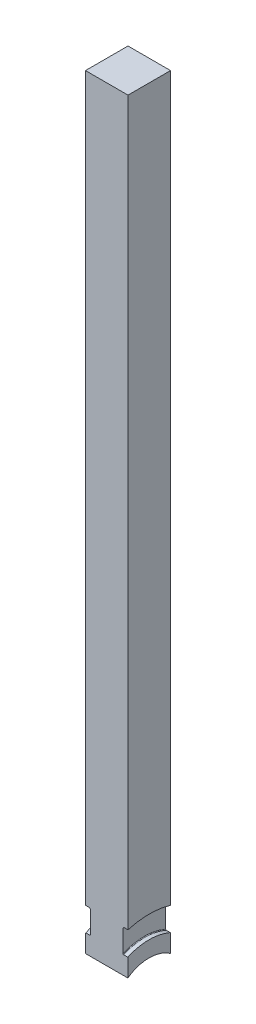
ISO-10303-21;
HEADER;
FILE_DESCRIPTION(('STEP AP214'),'2;1');
FILE_NAME('part.step','',(''),(''),'','','');
FILE_SCHEMA(('AUTOMOTIVE_DESIGN { 1 0 10303 214 1 1 1 1 }'));
ENDSEC;
DATA;
#1=APPLICATION_CONTEXT('core data for automotive mechanical design processes');
#2=APPLICATION_PROTOCOL_DEFINITION('international standard','automotive_design',2000,#1);
#3=PRODUCT_CONTEXT('',#1,'mechanical');
#4=PRODUCT('Part','Part','',(#3));
#5=PRODUCT_RELATED_PRODUCT_CATEGORY('part','',(#4));
#6=PRODUCT_DEFINITION_FORMATION('','',#4);
#7=PRODUCT_DEFINITION_CONTEXT('part definition',#1,'design');
#8=PRODUCT_DEFINITION('design','',#6,#7);
#9=PRODUCT_DEFINITION_SHAPE('','',#8);
#10=(LENGTH_UNIT() NAMED_UNIT(*) SI_UNIT(.MILLI.,.METRE.));
#11=(NAMED_UNIT(*) PLANE_ANGLE_UNIT() SI_UNIT($,.RADIAN.));
#12=(NAMED_UNIT(*) SI_UNIT($,.STERADIAN.) SOLID_ANGLE_UNIT());
#13=UNCERTAINTY_MEASURE_WITH_UNIT(LENGTH_MEASURE(1.E-05),#10,'distance_accuracy_value','');
#14=(GEOMETRIC_REPRESENTATION_CONTEXT(3) GLOBAL_UNCERTAINTY_ASSIGNED_CONTEXT((#13)) GLOBAL_UNIT_ASSIGNED_CONTEXT((#10,
#11,#12)) REPRESENTATION_CONTEXT('',''));
#15=CARTESIAN_POINT('',(0.,0.,0.));
#16=DIRECTION('',(0.,0.,1.));
#17=DIRECTION('',(1.,0.,0.));
#18=AXIS2_PLACEMENT_3D('',#15,#16,#17);
#19=CARTESIAN_POINT('',(12.827,479.425,12.827));
#20=DIRECTION('',(0.,0.,-1.));
#21=DIRECTION('',(0.,1.,0.));
#22=AXIS2_PLACEMENT_3D('',#19,#20,#21);
#23=PLANE('',#22);
#24=DIRECTION('',(-1.,0.,0.));
#25=VECTOR('',#24,1.);
#26=CARTESIAN_POINT('',(-8.84822894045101,29.043597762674,12.827));
#27=LINE('',#26,#25);
#28=CARTESIAN_POINT('',(-12.7,29.043597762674,12.827));
#29=VERTEX_POINT('',#28);
#30=CARTESIAN_POINT('',(-10.2362,29.043597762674,12.827));
#31=VERTEX_POINT('',#30);
#32=EDGE_CURVE('E196',#29,#31,#27,.F.);
#33=ORIENTED_EDGE('',*,*,#32,.F.);
#34=DIRECTION('',(0.,1.,0.));
#35=VECTOR('',#34,1.);
#36=CARTESIAN_POINT('',(-12.7,31.75,12.827));
#37=LINE('',#36,#35);
#38=CARTESIAN_POINT('',(-12.7,18.149895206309,12.827));
#39=VERTEX_POINT('',#38);
#40=EDGE_CURVE('E178',#39,#29,#37,.T.);
#41=ORIENTED_EDGE('',*,*,#40,.F.);
#42=DIRECTION('',(1.,0.,0.));
#43=VECTOR('',#42,1.);
#44=CARTESIAN_POINT('',(-12.827,18.1498952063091,12.827));
#45=LINE('',#44,#43);
#46=CARTESIAN_POINT('',(12.7,18.149895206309,12.827));
#47=VERTEX_POINT('',#46);
#48=EDGE_CURVE('E176',#39,#47,#45,.T.);
#49=ORIENTED_EDGE('',*,*,#48,.T.);
#50=DIRECTION('',(0.,-1.,0.));
#51=VECTOR('',#50,1.);
#52=CARTESIAN_POINT('',(12.7,31.75,12.827));
#53=LINE('',#52,#51);
#54=CARTESIAN_POINT('',(12.7,29.043597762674,12.827));
#55=VERTEX_POINT('',#54);
#56=EDGE_CURVE('E165',#55,#47,#53,.T.);
#57=ORIENTED_EDGE('',*,*,#56,.F.);
#58=DIRECTION('',(-1.,0.,0.));
#59=VECTOR('',#58,1.);
#60=CARTESIAN_POINT('',(-8.84822894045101,29.043597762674,12.827));
#61=LINE('',#60,#59);
#62=CARTESIAN_POINT('',(10.2362,29.043597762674,12.827));
#63=VERTEX_POINT('',#62);
#64=EDGE_CURVE('E152',#63,#55,#61,.F.);
#65=ORIENTED_EDGE('',*,*,#64,.F.);
#66=CARTESIAN_POINT('',(10.2362,29.043597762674,12.827));
#67=CARTESIAN_POINT('',(10.2160708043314,29.0435722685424,12.827));
#68=CARTESIAN_POINT('',(10.1959577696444,29.0453398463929,12.827));
#69=CARTESIAN_POINT('',(10.1563845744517,29.0522597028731,12.827));
#70=CARTESIAN_POINT('',(10.1369225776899,29.057401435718,12.827));
#71=CARTESIAN_POINT('',(10.0991468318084,29.0708679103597,12.827));
#72=CARTESIAN_POINT('',(10.0808326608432,29.0791914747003,12.827));
#73=CARTESIAN_POINT('',(10.0457902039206,29.0986936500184,12.827));
#74=CARTESIAN_POINT('',(10.0290627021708,29.1098736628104,12.827));
#75=CARTESIAN_POINT('',(9.99700861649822,29.1351379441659,12.827));
#76=CARTESIAN_POINT('',(9.98175149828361,29.1493101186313,12.827));
#77=CARTESIAN_POINT('',(9.95361671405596,29.1798419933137,12.827));
#78=CARTESIAN_POINT('',(9.9407396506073,29.1962022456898,12.827));
#79=CARTESIAN_POINT('',(9.91662869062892,29.2320467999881,12.827));
#80=CARTESIAN_POINT('',(9.90561137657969,29.2516766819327,12.827));
#81=CARTESIAN_POINT('',(9.8867485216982,29.2924113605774,12.827));
#82=CARTESIAN_POINT('',(9.87890468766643,29.3135169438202,12.827));
#83=CARTESIAN_POINT('',(9.86687995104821,29.3553145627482,12.827));
#84=CARTESIAN_POINT('',(9.86250087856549,29.375950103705,12.827));
#85=CARTESIAN_POINT('',(9.85666099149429,29.417597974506,12.827));
#86=CARTESIAN_POINT('',(9.85519567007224,29.4386096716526,12.827));
#87=CARTESIAN_POINT('',(9.8552,29.4596203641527,12.827));
#88=B_SPLINE_CURVE_WITH_KNOTS('',3,(#66,#67,#68,#69,#70,#71,#72,#73,#74,#75,#76,#77,#78,#79,#80,
#81,#82,#83,#84,#85,#86,#87),.UNSPECIFIED.,.F.,.F.,(4,2,2,2,2,2,2,2,2,2,4),(0.,
0.0602849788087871,0.120382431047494,0.180457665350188,0.240562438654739,0.302769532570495,
0.364992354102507,0.432238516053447,0.499520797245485,0.562601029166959,0.625583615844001),.UNSPECIFIED.);
#89=CARTESIAN_POINT('',(9.8552,29.4596203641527,12.827));
#90=VERTEX_POINT('',#89);
#91=EDGE_CURVE('E11',#63,#90,#88,.T.);
#92=ORIENTED_EDGE('',*,*,#91,.T.);
#93=DIRECTION('',(0.,-1.,0.));
#94=VECTOR('',#93,1.);
#95=CARTESIAN_POINT('',(9.8552,479.425,12.827));
#96=LINE('',#95,#94);
#97=CARTESIAN_POINT('',(9.8552,42.5855524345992,12.827));
#98=VERTEX_POINT('',#97);
#99=EDGE_CURVE('E211',#98,#90,#96,.T.);
#100=ORIENTED_EDGE('',*,*,#99,.F.);
#101=CARTESIAN_POINT('',(9.8552,42.5855524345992,12.827));
#102=CARTESIAN_POINT('',(9.85517024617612,42.6317662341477,12.827));
#103=CARTESIAN_POINT('',(9.85905310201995,42.6779817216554,12.827));
#104=CARTESIAN_POINT('',(9.87444611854,42.7691513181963,12.827));
#105=CARTESIAN_POINT('',(9.88596063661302,42.8141046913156,12.827));
#106=CARTESIAN_POINT('',(9.91643311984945,42.9014710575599,12.827));
#107=CARTESIAN_POINT('',(9.93539815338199,42.9438815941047,12.827));
#108=CARTESIAN_POINT('',(9.98032447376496,43.0247993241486,12.827));
#109=CARTESIAN_POINT('',(10.0062818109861,43.0633087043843,12.827));
#110=CARTESIAN_POINT('',(10.0639112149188,43.1343937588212,12.827));
#111=CARTESIAN_POINT('',(10.0954452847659,43.1670811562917,12.827));
#112=CARTESIAN_POINT('',(10.1637735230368,43.226428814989,12.827));
#113=CARTESIAN_POINT('',(10.200568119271,43.2530885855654,12.827));
#114=CARTESIAN_POINT('',(10.2767372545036,43.2984392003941,12.827));
#115=CARTESIAN_POINT('',(10.3159443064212,43.3174118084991,12.827));
#116=CARTESIAN_POINT('',(10.3970519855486,43.348201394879,12.827));
#117=CARTESIAN_POINT('',(10.438949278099,43.3600270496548,12.827));
#118=CARTESIAN_POINT('',(10.5038932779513,43.3722863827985,12.827));
#119=CARTESIAN_POINT('',(10.526453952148,43.3754629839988,12.827));
#120=CARTESIAN_POINT('',(10.571739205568,43.3796991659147,12.827));
#121=CARTESIAN_POINT('',(10.594463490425,43.3807618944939,12.827));
#122=CARTESIAN_POINT('',(10.6171999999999,43.3807610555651,12.827));
#123=B_SPLINE_CURVE_WITH_KNOTS('',3,(#101,#102,#103,#104,#105,#106,#107,#108,#109,#110,#111,
#112,#113,#114,#115,#116,#117,#118,#119,#120,#121,#122),.UNSPECIFIED.,.F.,.F.,(4,2,2,2,2,2,2,2,
2,2,4),(0.,0.138483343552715,0.277045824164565,0.415740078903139,0.554356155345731,
0.689928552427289,0.825511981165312,0.955539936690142,1.08540971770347,1.15367212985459,
1.22183281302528),.UNSPECIFIED.);
#124=CARTESIAN_POINT('',(10.6172,43.3807610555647,12.827));
#125=VERTEX_POINT('',#124);
#126=EDGE_CURVE('E295',#98,#125,#123,.T.);
#127=ORIENTED_EDGE('',*,*,#126,.T.);
#128=DIRECTION('',(-1.,0.,0.));
#129=VECTOR('',#128,1.);
#130=CARTESIAN_POINT('',(-8.84822894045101,43.3807610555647,12.827));
#131=LINE('',#130,#129);
#132=CARTESIAN_POINT('',(12.827,43.3807610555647,12.827));
#133=VERTEX_POINT('',#132);
#134=EDGE_CURVE('E206',#133,#125,#131,.T.);
#135=ORIENTED_EDGE('',*,*,#134,.F.);
#136=DIRECTION('',(0.,-1.,0.));
#137=VECTOR('',#136,1.);
#138=CARTESIAN_POINT('',(12.827,479.425,12.827));
#139=LINE('',#138,#137);
#140=CARTESIAN_POINT('',(12.827,479.425,12.827));
#141=VERTEX_POINT('',#140);
#142=EDGE_CURVE('E222',#141,#133,#139,.T.);
#143=ORIENTED_EDGE('',*,*,#142,.F.);
#144=DIRECTION('',(-1.,0.,0.));
#145=VECTOR('',#144,1.);
#146=CARTESIAN_POINT('',(12.827,479.425,12.827));
#147=LINE('',#146,#145);
#148=CARTESIAN_POINT('',(-12.827,479.425,12.827));
#149=VERTEX_POINT('',#148);
#150=EDGE_CURVE('E237',#141,#149,#147,.T.);
#151=ORIENTED_EDGE('',*,*,#150,.T.);
#152=DIRECTION('',(0.,-1.,0.));
#153=VECTOR('',#152,1.);
#154=CARTESIAN_POINT('',(-12.827,479.425,12.827));
#155=LINE('',#154,#153);
#156=CARTESIAN_POINT('',(-12.827,43.3807610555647,12.827));
#157=VERTEX_POINT('',#156);
#158=EDGE_CURVE('E231',#149,#157,#155,.T.);
#159=ORIENTED_EDGE('',*,*,#158,.T.);
#160=DIRECTION('',(-1.,0.,0.));
#161=VECTOR('',#160,1.);
#162=CARTESIAN_POINT('',(-8.84822894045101,43.3807610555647,12.827));
#163=LINE('',#162,#161);
#164=CARTESIAN_POINT('',(-10.6172,43.3807610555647,12.827));
#165=VERTEX_POINT('',#164);
#166=EDGE_CURVE('E202',#165,#157,#163,.T.);
#167=ORIENTED_EDGE('',*,*,#166,.F.);
#168=CARTESIAN_POINT('',(-10.6172,43.3807610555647,12.827));
#169=CARTESIAN_POINT('',(-10.5756065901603,43.3808045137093,12.827));
#170=CARTESIAN_POINT('',(-10.5340342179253,43.3772126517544,12.827));
#171=CARTESIAN_POINT('',(-10.4521637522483,43.363091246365,12.827));
#172=CARTESIAN_POINT('',(-10.411863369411,43.3525750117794,12.827));
#173=CARTESIAN_POINT('',(-10.3335975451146,43.3249343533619,12.827));
#174=CARTESIAN_POINT('',(-10.295632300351,43.3078093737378,12.827));
#175=CARTESIAN_POINT('',(-10.223045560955,43.2675367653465,12.827));
#176=CARTESIAN_POINT('',(-10.1884245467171,43.2443882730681,12.827));
#177=CARTESIAN_POINT('',(-10.1228284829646,43.1923475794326,12.827));
#178=CARTESIAN_POINT('',(-10.0919268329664,43.1633629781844,12.827));
#179=CARTESIAN_POINT('',(-10.0352031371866,43.1007883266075,12.827));
#180=CARTESIAN_POINT('',(-10.0093823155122,43.0671971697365,12.827));
#181=CARTESIAN_POINT('',(-9.96248271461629,42.9949745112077,12.827));
#182=CARTESIAN_POINT('',(-9.9416282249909,42.9561975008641,12.827));
#183=CARTESIAN_POINT('',(-9.90645002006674,42.8757858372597,12.827));
#184=CARTESIAN_POINT('',(-9.89212634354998,42.8341511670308,12.827));
#185=CARTESIAN_POINT('',(-9.87256356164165,42.7580053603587,12.827));
#186=CARTESIAN_POINT('',(-9.86605461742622,42.7238136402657,12.827));
#187=CARTESIAN_POINT('',(-9.85737265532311,42.6549344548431,12.827));
#188=CARTESIAN_POINT('',(-9.85519333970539,42.6202477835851,12.827));
#189=CARTESIAN_POINT('',(-9.85520000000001,42.5855524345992,12.827));
#190=B_SPLINE_CURVE_WITH_KNOTS('',3,(#168,#169,#170,#171,#172,#173,#174,#175,#176,#177,#178,
#179,#180,#181,#182,#183,#184,#185,#186,#187,#188,#189),.UNSPECIFIED.,.F.,.F.,(4,2,2,2,2,2,2,2,
2,2,4),(0.,0.124593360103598,0.248947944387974,0.373312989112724,0.497695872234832,
0.624229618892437,0.750793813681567,0.882295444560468,1.01379785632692,1.11794997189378,
1.22195048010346),.UNSPECIFIED.);
#191=CARTESIAN_POINT('',(-9.85520000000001,42.5855524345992,12.827));
#192=VERTEX_POINT('',#191);
#193=EDGE_CURVE('E264',#165,#192,#190,.T.);
#194=ORIENTED_EDGE('',*,*,#193,.T.);
#195=DIRECTION('',(0.,1.,0.));
#196=VECTOR('',#195,1.);
#197=CARTESIAN_POINT('',(-9.85520000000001,479.425,12.827));
#198=LINE('',#197,#196);
#199=CARTESIAN_POINT('',(-9.85520000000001,29.4596203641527,12.827));
#200=VERTEX_POINT('',#199);
#201=EDGE_CURVE('E160',#200,#192,#198,.T.);
#202=ORIENTED_EDGE('',*,*,#201,.F.);
#203=CARTESIAN_POINT('',(-9.85520000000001,29.4596203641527,12.827));
#204=CARTESIAN_POINT('',(-9.85518989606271,29.434572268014,12.827));
#205=CARTESIAN_POINT('',(-9.85727632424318,29.4095174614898,12.827));
#206=CARTESIAN_POINT('',(-9.86557747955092,29.3600490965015,12.827));
#207=CARTESIAN_POINT('',(-9.87180075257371,29.3356369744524,12.827));
#208=CARTESIAN_POINT('',(-9.8883214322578,29.2881862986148,12.827));
#209=CARTESIAN_POINT('',(-9.89862433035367,29.2651496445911,12.827));
#210=CARTESIAN_POINT('',(-9.92312499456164,29.2212642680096,12.827));
#211=CARTESIAN_POINT('',(-9.93731902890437,29.2004134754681,12.827));
#212=CARTESIAN_POINT('',(-9.96856972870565,29.1625759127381,12.827));
#213=CARTESIAN_POINT('',(-9.98546338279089,29.145454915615,12.827));
#214=CARTESIAN_POINT('',(-10.0221325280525,29.1146162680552,12.827));
#215=CARTESIAN_POINT('',(-10.0419075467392,29.1008980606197,12.827));
#216=CARTESIAN_POINT('',(-10.0819198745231,29.0785475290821,12.827));
#217=CARTESIAN_POINT('',(-10.1019691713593,29.0695778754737,12.827));
#218=CARTESIAN_POINT('',(-10.1433538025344,29.0554628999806,12.827));
#219=CARTESIAN_POINT('',(-10.1646864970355,29.0503099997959,12.827));
#220=CARTESIAN_POINT('',(-10.1945530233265,29.0459922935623,12.827));
#221=CARTESIAN_POINT('',(-10.2028633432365,29.0450944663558,12.827));
#222=CARTESIAN_POINT('',(-10.2195142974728,29.0438978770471,12.827));
#223=CARTESIAN_POINT('',(-10.2278548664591,29.0435982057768,12.827));
#224=CARTESIAN_POINT('',(-10.2362,29.043597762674,12.827));
#225=B_SPLINE_CURVE_WITH_KNOTS('',3,(#203,#204,#205,#206,#207,#208,#209,#210,#211,#212,#213,
#214,#215,#216,#217,#218,#219,#220,#221,#222,#223,#224),.UNSPECIFIED.,.F.,.F.,(4,2,2,2,2,2,2,2,
2,2,4),(0.,0.0750698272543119,0.150295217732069,0.225622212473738,0.300877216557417,
0.372647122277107,0.444405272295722,0.509955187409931,0.57537459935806,0.600433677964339,
0.625454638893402),.UNSPECIFIED.);
#226=EDGE_CURVE('E309',#200,#31,#225,.T.);
#227=ORIENTED_EDGE('',*,*,#226,.T.);
#228=EDGE_LOOP('',(#33,#41,#49,#57,#65,#92,#100,#127,#135,#143,#151,#159,#167,#194,#202,#227));
#229=FACE_BOUND('',#228,.T.);
#230=ADVANCED_FACE('F37',(#229),#23,.F.);
#231=CARTESIAN_POINT('',(12.827,479.425,-12.827));
#232=DIRECTION('',(0.,0.,1.));
#233=DIRECTION('',(0.,-1.,0.));
#234=AXIS2_PLACEMENT_3D('',#231,#232,#233);
#235=PLANE('',#234);
#236=DIRECTION('',(1.,0.,0.));
#237=VECTOR('',#236,1.);
#238=CARTESIAN_POINT('',(-12.827,18.149895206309,-12.827));
#239=LINE('',#238,#237);
#240=CARTESIAN_POINT('',(12.7,18.149895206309,-12.827));
#241=VERTEX_POINT('',#240);
#242=CARTESIAN_POINT('',(-12.7,18.149895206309,-12.827));
#243=VERTEX_POINT('',#242);
#244=EDGE_CURVE('E214',#241,#243,#239,.F.);
#245=ORIENTED_EDGE('',*,*,#244,.T.);
#246=DIRECTION('',(0.,1.,0.));
#247=VECTOR('',#246,1.);
#248=CARTESIAN_POINT('',(-12.7,31.75,-12.827));
#249=LINE('',#248,#247);
#250=CARTESIAN_POINT('',(-12.7,29.043597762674,-12.827));
#251=VERTEX_POINT('',#250);
#252=EDGE_CURVE('E181',#243,#251,#249,.T.);
#253=ORIENTED_EDGE('',*,*,#252,.T.);
#254=DIRECTION('',(-1.,0.,0.));
#255=VECTOR('',#254,1.);
#256=CARTESIAN_POINT('',(-8.84822894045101,29.043597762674,-12.827));
#257=LINE('',#256,#255);
#258=CARTESIAN_POINT('',(-10.2362,29.043597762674,-12.827));
#259=VERTEX_POINT('',#258);
#260=EDGE_CURVE('E193',#259,#251,#257,.T.);
#261=ORIENTED_EDGE('',*,*,#260,.F.);
#262=CARTESIAN_POINT('',(-10.2362,29.043597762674,-12.827));
#263=CARTESIAN_POINT('',(-10.2160708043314,29.0435722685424,-12.827));
#264=CARTESIAN_POINT('',(-10.1959577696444,29.0453398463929,-12.827));
#265=CARTESIAN_POINT('',(-10.1563845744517,29.0522597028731,-12.827));
#266=CARTESIAN_POINT('',(-10.1369225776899,29.0574014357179,-12.827));
#267=CARTESIAN_POINT('',(-10.0991468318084,29.0708679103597,-12.827));
#268=CARTESIAN_POINT('',(-10.0808326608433,29.0791914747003,-12.827));
#269=CARTESIAN_POINT('',(-10.0457902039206,29.0986936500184,-12.827));
#270=CARTESIAN_POINT('',(-10.0290627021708,29.1098736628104,-12.827));
#271=CARTESIAN_POINT('',(-9.99700861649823,29.1351379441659,-12.827));
#272=CARTESIAN_POINT('',(-9.98175149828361,29.1493101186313,-12.827));
#273=CARTESIAN_POINT('',(-9.95361671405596,29.1798419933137,-12.827));
#274=CARTESIAN_POINT('',(-9.94073965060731,29.1962022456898,-12.827));
#275=CARTESIAN_POINT('',(-9.91662869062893,29.2320467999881,-12.827));
#276=CARTESIAN_POINT('',(-9.9056113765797,29.2516766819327,-12.827));
#277=CARTESIAN_POINT('',(-9.88674852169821,29.2924113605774,-12.827));
#278=CARTESIAN_POINT('',(-9.87890468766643,29.3135169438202,-12.827));
#279=CARTESIAN_POINT('',(-9.86687995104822,29.3553145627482,-12.827));
#280=CARTESIAN_POINT('',(-9.86250087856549,29.375950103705,-12.827));
#281=CARTESIAN_POINT('',(-9.85666099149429,29.4175979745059,-12.827));
#282=CARTESIAN_POINT('',(-9.85519567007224,29.4386096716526,-12.827));
#283=CARTESIAN_POINT('',(-9.85520000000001,29.4596203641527,-12.827));
#284=B_SPLINE_CURVE_WITH_KNOTS('',3,(#262,#263,#264,#265,#266,#267,#268,#269,#270,#271,#272,
#273,#274,#275,#276,#277,#278,#279,#280,#281,#282,#283),.UNSPECIFIED.,.F.,.F.,(4,2,2,2,2,2,2,2,
2,2,4),(0.,0.0602849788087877,0.120382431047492,0.180457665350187,0.240562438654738,
0.302769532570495,0.364992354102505,0.432238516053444,0.49952079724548,0.562601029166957,
0.625583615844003),.UNSPECIFIED.);
#285=CARTESIAN_POINT('',(-9.85520000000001,29.4596203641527,-12.827));
#286=VERTEX_POINT('',#285);
#287=EDGE_CURVE('E315',#259,#286,#284,.T.);
#288=ORIENTED_EDGE('',*,*,#287,.T.);
#289=DIRECTION('',(0.,-1.,0.));
#290=VECTOR('',#289,1.);
#291=CARTESIAN_POINT('',(-9.85520000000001,479.425,-12.827));
#292=LINE('',#291,#290);
#293=CARTESIAN_POINT('',(-9.85520000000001,42.5855524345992,-12.827));
#294=VERTEX_POINT('',#293);
#295=EDGE_CURVE('E240',#294,#286,#292,.T.);
#296=ORIENTED_EDGE('',*,*,#295,.F.);
#297=CARTESIAN_POINT('',(-9.85520000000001,42.5855524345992,-12.827));
#298=CARTESIAN_POINT('',(-9.85517024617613,42.6317662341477,-12.827));
#299=CARTESIAN_POINT('',(-9.85905310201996,42.6779817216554,-12.827));
#300=CARTESIAN_POINT('',(-9.87444611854,42.7691513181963,-12.827));
#301=CARTESIAN_POINT('',(-9.88596063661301,42.8141046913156,-12.827));
#302=CARTESIAN_POINT('',(-9.91643311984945,42.9014710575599,-12.827));
#303=CARTESIAN_POINT('',(-9.935398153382,42.9438815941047,-12.827));
#304=CARTESIAN_POINT('',(-9.98032447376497,43.0247993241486,-12.827));
#305=CARTESIAN_POINT('',(-10.0062818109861,43.0633087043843,-12.827));
#306=CARTESIAN_POINT('',(-10.0639112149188,43.1343937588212,-12.827));
#307=CARTESIAN_POINT('',(-10.0954452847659,43.1670811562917,-12.827));
#308=CARTESIAN_POINT('',(-10.1637735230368,43.226428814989,-12.827));
#309=CARTESIAN_POINT('',(-10.200568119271,43.2530885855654,-12.827));
#310=CARTESIAN_POINT('',(-10.2767372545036,43.2984392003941,-12.827));
#311=CARTESIAN_POINT('',(-10.3159443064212,43.3174118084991,-12.827));
#312=CARTESIAN_POINT('',(-10.3970519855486,43.348201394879,-12.827));
#313=CARTESIAN_POINT('',(-10.438949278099,43.3600270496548,-12.827));
#314=CARTESIAN_POINT('',(-10.5038932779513,43.3722863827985,-12.827));
#315=CARTESIAN_POINT('',(-10.526453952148,43.3754629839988,-12.827));
#316=CARTESIAN_POINT('',(-10.571739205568,43.3796991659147,-12.827));
#317=CARTESIAN_POINT('',(-10.594463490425,43.3807618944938,-12.827));
#318=CARTESIAN_POINT('',(-10.6171999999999,43.3807610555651,-12.827));
#319=B_SPLINE_CURVE_WITH_KNOTS('',3,(#297,#298,#299,#300,#301,#302,#303,#304,#305,#306,#307,
#308,#309,#310,#311,#312,#313,#314,#315,#316,#317,#318),.UNSPECIFIED.,.F.,.F.,(4,2,2,2,2,2,2,2,
2,2,4),(0.,0.138483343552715,0.277045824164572,0.415740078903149,0.554356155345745,
0.689928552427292,0.825511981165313,0.955539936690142,1.08540971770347,1.1536721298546,
1.22183281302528),.UNSPECIFIED.);
#320=CARTESIAN_POINT('',(-10.6172,43.3807610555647,-12.827));
#321=VERTEX_POINT('',#320);
#322=EDGE_CURVE('E256',#294,#321,#319,.T.);
#323=ORIENTED_EDGE('',*,*,#322,.T.);
#324=DIRECTION('',(-1.,0.,0.));
#325=VECTOR('',#324,1.);
#326=CARTESIAN_POINT('',(-8.84822894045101,43.3807610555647,-12.827));
#327=LINE('',#326,#325);
#328=CARTESIAN_POINT('',(-12.827,43.3807610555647,-12.827));
#329=VERTEX_POINT('',#328);
#330=EDGE_CURVE('E199',#329,#321,#327,.F.);
#331=ORIENTED_EDGE('',*,*,#330,.F.);
#332=DIRECTION('',(0.,1.,0.));
#333=VECTOR('',#332,1.);
#334=CARTESIAN_POINT('',(-12.827,479.425,-12.827));
#335=LINE('',#334,#333);
#336=CARTESIAN_POINT('',(-12.827,479.425,-12.827));
#337=VERTEX_POINT('',#336);
#338=EDGE_CURVE('E223',#329,#337,#335,.T.);
#339=ORIENTED_EDGE('',*,*,#338,.T.);
#340=DIRECTION('',(-1.,0.,0.));
#341=VECTOR('',#340,1.);
#342=CARTESIAN_POINT('',(12.827,479.425,-12.827));
#343=LINE('',#342,#341);
#344=CARTESIAN_POINT('',(12.827,479.425,-12.827));
#345=VERTEX_POINT('',#344);
#346=EDGE_CURVE('E228',#345,#337,#343,.T.);
#347=ORIENTED_EDGE('',*,*,#346,.F.);
#348=DIRECTION('',(0.,1.,0.));
#349=VECTOR('',#348,1.);
#350=CARTESIAN_POINT('',(12.827,479.425,-12.827));
#351=LINE('',#350,#349);
#352=CARTESIAN_POINT('',(12.827,43.3807610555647,-12.827));
#353=VERTEX_POINT('',#352);
#354=EDGE_CURVE('E226',#353,#345,#351,.T.);
#355=ORIENTED_EDGE('',*,*,#354,.F.);
#356=DIRECTION('',(-1.,0.,0.));
#357=VECTOR('',#356,1.);
#358=CARTESIAN_POINT('',(-8.84822894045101,43.3807610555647,-12.827));
#359=LINE('',#358,#357);
#360=CARTESIAN_POINT('',(10.6172,43.3807610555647,-12.827));
#361=VERTEX_POINT('',#360);
#362=EDGE_CURVE('E204',#361,#353,#359,.F.);
#363=ORIENTED_EDGE('',*,*,#362,.F.);
#364=CARTESIAN_POINT('',(10.6172,43.3807610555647,-12.827));
#365=CARTESIAN_POINT('',(10.5756065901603,43.3808045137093,-12.827));
#366=CARTESIAN_POINT('',(10.5340342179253,43.3772126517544,-12.827));
#367=CARTESIAN_POINT('',(10.4521637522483,43.363091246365,-12.827));
#368=CARTESIAN_POINT('',(10.411863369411,43.3525750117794,-12.827));
#369=CARTESIAN_POINT('',(10.3335975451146,43.3249343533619,-12.827));
#370=CARTESIAN_POINT('',(10.295632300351,43.3078093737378,-12.827));
#371=CARTESIAN_POINT('',(10.223045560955,43.2675367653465,-12.827));
#372=CARTESIAN_POINT('',(10.1884245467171,43.2443882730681,-12.827));
#373=CARTESIAN_POINT('',(10.1228284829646,43.1923475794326,-12.827));
#374=CARTESIAN_POINT('',(10.0919268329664,43.1633629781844,-12.827));
#375=CARTESIAN_POINT('',(10.0352031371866,43.1007883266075,-12.827));
#376=CARTESIAN_POINT('',(10.0093823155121,43.0671971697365,-12.827));
#377=CARTESIAN_POINT('',(9.96248271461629,42.9949745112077,-12.827));
#378=CARTESIAN_POINT('',(9.9416282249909,42.9561975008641,-12.827));
#379=CARTESIAN_POINT('',(9.90645002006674,42.8757858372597,-12.827));
#380=CARTESIAN_POINT('',(9.89212634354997,42.8341511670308,-12.827));
#381=CARTESIAN_POINT('',(9.87256356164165,42.7580053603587,-12.827));
#382=CARTESIAN_POINT('',(9.86605461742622,42.7238136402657,-12.827));
#383=CARTESIAN_POINT('',(9.85737265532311,42.6549344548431,-12.827));
#384=CARTESIAN_POINT('',(9.85519333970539,42.6202477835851,-12.827));
#385=CARTESIAN_POINT('',(9.8552,42.5855524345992,-12.827));
#386=B_SPLINE_CURVE_WITH_KNOTS('',3,(#364,#365,#366,#367,#368,#369,#370,#371,#372,#373,#374,
#375,#376,#377,#378,#379,#380,#381,#382,#383,#384,#385),.UNSPECIFIED.,.F.,.F.,(4,2,2,2,2,2,2,2,
2,2,4),(0.,0.1245933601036,0.248947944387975,0.373312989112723,0.497695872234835,
0.624229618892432,0.750793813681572,0.88229544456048,1.01379785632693,1.11794997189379,
1.22195048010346),.UNSPECIFIED.);
#387=CARTESIAN_POINT('',(9.8552,42.5855524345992,-12.827));
#388=VERTEX_POINT('',#387);
#389=EDGE_CURVE('E289',#361,#388,#386,.T.);
#390=ORIENTED_EDGE('',*,*,#389,.T.);
#391=DIRECTION('',(0.,1.,0.));
#392=VECTOR('',#391,1.);
#393=CARTESIAN_POINT('',(9.8552,479.425,-12.827));
#394=LINE('',#393,#392);
#395=CARTESIAN_POINT('',(9.8552,29.4596203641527,-12.827));
#396=VERTEX_POINT('',#395);
#397=EDGE_CURVE('E170',#396,#388,#394,.T.);
#398=ORIENTED_EDGE('',*,*,#397,.F.);
#399=CARTESIAN_POINT('',(9.8552,29.4596203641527,-12.827));
#400=CARTESIAN_POINT('',(9.85518989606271,29.434572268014,-12.827));
#401=CARTESIAN_POINT('',(9.85727632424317,29.4095174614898,-12.827));
#402=CARTESIAN_POINT('',(9.86557747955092,29.3600490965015,-12.827));
#403=CARTESIAN_POINT('',(9.87180075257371,29.3356369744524,-12.827));
#404=CARTESIAN_POINT('',(9.8883214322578,29.2881862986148,-12.827));
#405=CARTESIAN_POINT('',(9.89862433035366,29.2651496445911,-12.827));
#406=CARTESIAN_POINT('',(9.92312499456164,29.2212642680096,-12.827));
#407=CARTESIAN_POINT('',(9.93731902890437,29.200413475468,-12.827));
#408=CARTESIAN_POINT('',(9.96856972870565,29.1625759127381,-12.827));
#409=CARTESIAN_POINT('',(9.98546338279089,29.145454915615,-12.827));
#410=CARTESIAN_POINT('',(10.0221325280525,29.1146162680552,-12.827));
#411=CARTESIAN_POINT('',(10.0419075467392,29.1008980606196,-12.827));
#412=CARTESIAN_POINT('',(10.081919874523,29.0785475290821,-12.827));
#413=CARTESIAN_POINT('',(10.1019691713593,29.0695778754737,-12.827));
#414=CARTESIAN_POINT('',(10.1433538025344,29.0554628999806,-12.827));
#415=CARTESIAN_POINT('',(10.1646864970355,29.0503099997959,-12.827));
#416=CARTESIAN_POINT('',(10.1945530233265,29.0459922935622,-12.827));
#417=CARTESIAN_POINT('',(10.2028633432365,29.0450944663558,-12.827));
#418=CARTESIAN_POINT('',(10.2195142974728,29.043897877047,-12.827));
#419=CARTESIAN_POINT('',(10.2278548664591,29.0435982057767,-12.827));
#420=CARTESIAN_POINT('',(10.2362,29.0435977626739,-12.827));
#421=B_SPLINE_CURVE_WITH_KNOTS('',3,(#399,#400,#401,#402,#403,#404,#405,#406,#407,#408,#409,
#410,#411,#412,#413,#414,#415,#416,#417,#418,#419,#420),.UNSPECIFIED.,.F.,.F.,(4,2,2,2,2,2,2,2,
2,2,4),(0.,0.0750698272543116,0.150295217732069,0.225622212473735,0.300877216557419,
0.372647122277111,0.444405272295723,0.509955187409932,0.575374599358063,0.600433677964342,
0.625454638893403),.UNSPECIFIED.);
#422=CARTESIAN_POINT('',(10.2362,29.043597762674,-12.827));
#423=VERTEX_POINT('',#422);
#424=EDGE_CURVE('E51',#396,#423,#421,.T.);
#425=ORIENTED_EDGE('',*,*,#424,.T.);
#426=DIRECTION('',(-1.,0.,0.));
#427=VECTOR('',#426,1.);
#428=CARTESIAN_POINT('',(-8.84822894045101,29.043597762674,-12.827));
#429=LINE('',#428,#427);
#430=CARTESIAN_POINT('',(12.7,29.043597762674,-12.827));
#431=VERTEX_POINT('',#430);
#432=EDGE_CURVE('E161',#431,#423,#429,.T.);
#433=ORIENTED_EDGE('',*,*,#432,.F.);
#434=DIRECTION('',(0.,-1.,0.));
#435=VECTOR('',#434,1.);
#436=CARTESIAN_POINT('',(12.7,31.75,-12.827));
#437=LINE('',#436,#435);
#438=EDGE_CURVE('E168',#431,#241,#437,.T.);
#439=ORIENTED_EDGE('',*,*,#438,.T.);
#440=EDGE_LOOP('',(#245,#253,#261,#288,#296,#323,#331,#339,#347,#355,#363,#390,#398,#425,#433,#439));
#441=FACE_BOUND('',#440,.T.);
#442=ADVANCED_FACE('F270',(#441),#235,.F.);
#443=CARTESIAN_POINT('',(-12.827,0.,0.));
#444=DIRECTION('',(-1.,0.,0.));
#445=DIRECTION('',(0.,0.,1.));
#446=AXIS2_PLACEMENT_3D('',#443,#444,#445);
#447=PLANE('',#446);
#448=ORIENTED_EDGE('',*,*,#338,.F.);
#449=CARTESIAN_POINT('',(-12.827,0.,0.));
#450=DIRECTION('',(-1.,0.,0.));
#451=DIRECTION('',(0.,0.,1.));
#452=AXIS2_PLACEMENT_3D('',#449,#450,#451);
#453=CIRCLE('',#452,45.2374);
#454=EDGE_CURVE('E189',#157,#329,#453,.T.);
#455=ORIENTED_EDGE('',*,*,#454,.F.);
#456=ORIENTED_EDGE('',*,*,#158,.F.);
#457=DIRECTION('',(0.,0.,1.));
#458=VECTOR('',#457,1.);
#459=CARTESIAN_POINT('',(-12.827,479.425,12.827));
#460=LINE('',#459,#458);
#461=EDGE_CURVE('E218',#337,#149,#460,.T.);
#462=ORIENTED_EDGE('',*,*,#461,.F.);
#463=EDGE_LOOP('',(#448,#455,#456,#462));
#464=FACE_BOUND('',#463,.T.);
#465=ADVANCED_FACE('F378',(#464),#447,.T.);
#466=CARTESIAN_POINT('',(12.827,479.425,12.827));
#467=DIRECTION('',(0.,-1.,0.));
#468=DIRECTION('',(0.,0.,-1.));
#469=AXIS2_PLACEMENT_3D('',#466,#467,#468);
#470=PLANE('',#469);
#471=ORIENTED_EDGE('',*,*,#461,.T.);
#472=ORIENTED_EDGE('',*,*,#150,.F.);
#473=DIRECTION('',(0.,0.,1.));
#474=VECTOR('',#473,1.);
#475=CARTESIAN_POINT('',(12.827,479.425,12.827));
#476=LINE('',#475,#474);
#477=EDGE_CURVE('E219',#345,#141,#476,.T.);
#478=ORIENTED_EDGE('',*,*,#477,.F.);
#479=ORIENTED_EDGE('',*,*,#346,.T.);
#480=EDGE_LOOP('',(#471,#472,#478,#479));
#481=FACE_BOUND('',#480,.T.);
#482=ADVANCED_FACE('F281',(#481),#470,.F.);
#483=CARTESIAN_POINT('',(12.827,0.,0.));
#484=DIRECTION('',(-1.,0.,0.));
#485=DIRECTION('',(0.,0.,1.));
#486=AXIS2_PLACEMENT_3D('',#483,#484,#485);
#487=PLANE('',#486);
#488=CARTESIAN_POINT('',(12.827,0.,0.));
#489=DIRECTION('',(-1.,0.,0.));
#490=DIRECTION('',(0.,0.,1.));
#491=AXIS2_PLACEMENT_3D('',#488,#489,#490);
#492=CIRCLE('',#491,45.2374);
#493=EDGE_CURVE('E190',#133,#353,#492,.T.);
#494=ORIENTED_EDGE('',*,*,#493,.T.);
#495=ORIENTED_EDGE('',*,*,#354,.T.);
#496=ORIENTED_EDGE('',*,*,#477,.T.);
#497=ORIENTED_EDGE('',*,*,#142,.T.);
#498=EDGE_LOOP('',(#494,#495,#496,#497));
#499=FACE_BOUND('',#498,.T.);
#500=ADVANCED_FACE('F366',(#499),#487,.F.);
#501=CARTESIAN_POINT('',(-12.827,0.,0.));
#502=DIRECTION('',(1.,0.,0.));
#503=DIRECTION('',(0.,0.,-1.));
#504=AXIS2_PLACEMENT_3D('',#501,#502,#503);
#505=CYLINDRICAL_SURFACE('',#504,22.225);
#506=ORIENTED_EDGE('',*,*,#48,.F.);
#507=CARTESIAN_POINT('',(-12.7,0.,0.));
#508=DIRECTION('',(1.,0.,0.));
#509=DIRECTION('',(0.,1.,0.));
#510=AXIS2_PLACEMENT_3D('',#507,#508,#509);
#511=CIRCLE('',#510,22.225);
#512=EDGE_CURVE('E186',#39,#243,#511,.F.);
#513=ORIENTED_EDGE('',*,*,#512,.T.);
#514=ORIENTED_EDGE('',*,*,#244,.F.);
#515=CARTESIAN_POINT('',(12.7,0.,0.));
#516=DIRECTION('',(-1.,0.,0.));
#517=DIRECTION('',(0.,-1.,0.));
#518=AXIS2_PLACEMENT_3D('',#515,#516,#517);
#519=CIRCLE('',#518,22.225);
#520=EDGE_CURVE('E184',#241,#47,#519,.F.);
#521=ORIENTED_EDGE('',*,*,#520,.T.);
#522=EDGE_LOOP('',(#506,#513,#514,#521));
#523=FACE_BOUND('',#522,.T.);
#524=ADVANCED_FACE('F385',(#523),#505,.F.);
#525=CARTESIAN_POINT('',(-9.85520000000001,31.75,0.));
#526=DIRECTION('',(-1.,0.,0.));
#527=DIRECTION('',(0.,0.,1.));
#528=AXIS2_PLACEMENT_3D('',#525,#526,#527);
#529=PLANE('',#528);
#530=ORIENTED_EDGE('',*,*,#295,.T.);
#531=CARTESIAN_POINT('',(-9.85520000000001,0.,0.));
#532=DIRECTION('',(-1.,0.,0.));
#533=DIRECTION('',(0.,0.,1.));
#534=AXIS2_PLACEMENT_3D('',#531,#532,#533);
#535=CIRCLE('',#534,32.131);
#536=EDGE_CURVE('E328',#286,#200,#535,.F.);
#537=ORIENTED_EDGE('',*,*,#536,.T.);
#538=ORIENTED_EDGE('',*,*,#201,.T.);
#539=CARTESIAN_POINT('',(-9.85520000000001,0.,0.));
#540=DIRECTION('',(-1.,0.,0.));
#541=DIRECTION('',(0.,0.,1.));
#542=AXIS2_PLACEMENT_3D('',#539,#540,#541);
#543=CIRCLE('',#542,44.4754);
#544=EDGE_CURVE('E246',#192,#294,#543,.T.);
#545=ORIENTED_EDGE('',*,*,#544,.T.);
#546=EDGE_LOOP('',(#530,#537,#538,#545));
#547=FACE_BOUND('',#546,.T.);
#548=ADVANCED_FACE('F383',(#547),#529,.T.);
#549=CARTESIAN_POINT('',(-8.84822894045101,0.,0.));
#550=DIRECTION('',(-1.,0.,0.));
#551=DIRECTION('',(0.,0.,1.));
#552=AXIS2_PLACEMENT_3D('',#549,#550,#551);
#553=CYLINDRICAL_SURFACE('',#552,45.2374);
#554=ORIENTED_EDGE('',*,*,#330,.T.);
#555=CARTESIAN_POINT('',(-10.6172,0.,0.));
#556=DIRECTION('',(-1.,0.,0.));
#557=DIRECTION('',(0.,0.,1.));
#558=AXIS2_PLACEMENT_3D('',#555,#556,#557);
#559=CIRCLE('',#558,45.2374);
#560=EDGE_CURVE('E249',#321,#165,#559,.F.);
#561=ORIENTED_EDGE('',*,*,#560,.T.);
#562=ORIENTED_EDGE('',*,*,#166,.T.);
#563=ORIENTED_EDGE('',*,*,#454,.T.);
#564=EDGE_LOOP('',(#554,#561,#562,#563));
#565=FACE_BOUND('',#564,.T.);
#566=ADVANCED_FACE('F380',(#565),#553,.F.);
#567=CARTESIAN_POINT('',(-8.84822894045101,0.,0.));
#568=DIRECTION('',(-1.,0.,0.));
#569=DIRECTION('',(0.,0.,1.));
#570=AXIS2_PLACEMENT_3D('',#567,#568,#569);
#571=CYLINDRICAL_SURFACE('',#570,31.75);
#572=ORIENTED_EDGE('',*,*,#32,.T.);
#573=CARTESIAN_POINT('',(-10.2362,0.,0.));
#574=DIRECTION('',(-1.,0.,0.));
#575=DIRECTION('',(0.,0.,1.));
#576=AXIS2_PLACEMENT_3D('',#573,#574,#575);
#577=CIRCLE('',#576,31.75);
#578=EDGE_CURVE('E301',#31,#259,#577,.T.);
#579=ORIENTED_EDGE('',*,*,#578,.T.);
#580=ORIENTED_EDGE('',*,*,#260,.T.);
#581=CARTESIAN_POINT('',(-12.7,0.,0.));
#582=DIRECTION('',(1.,0.,0.));
#583=DIRECTION('',(0.,1.,0.));
#584=AXIS2_PLACEMENT_3D('',#581,#582,#583);
#585=CIRCLE('',#584,31.75);
#586=EDGE_CURVE('E169',#29,#251,#585,.F.);
#587=ORIENTED_EDGE('',*,*,#586,.F.);
#588=EDGE_LOOP('',(#572,#579,#580,#587));
#589=FACE_BOUND('',#588,.T.);
#590=ADVANCED_FACE('F336',(#589),#571,.T.);
#591=CARTESIAN_POINT('',(9.8552,31.75,0.));
#592=DIRECTION('',(1.,0.,0.));
#593=DIRECTION('',(0.,0.,-1.));
#594=AXIS2_PLACEMENT_3D('',#591,#592,#593);
#595=PLANE('',#594);
#596=ORIENTED_EDGE('',*,*,#99,.T.);
#597=CARTESIAN_POINT('',(9.8552,0.,0.));
#598=DIRECTION('',(1.,0.,0.));
#599=DIRECTION('',(0.,0.,-1.));
#600=AXIS2_PLACEMENT_3D('',#597,#598,#599);
#601=CIRCLE('',#600,32.131);
#602=EDGE_CURVE('E326',#90,#396,#601,.F.);
#603=ORIENTED_EDGE('',*,*,#602,.T.);
#604=ORIENTED_EDGE('',*,*,#397,.T.);
#605=CARTESIAN_POINT('',(9.8552,0.,0.));
#606=DIRECTION('',(1.,0.,0.));
#607=DIRECTION('',(0.,0.,-1.));
#608=AXIS2_PLACEMENT_3D('',#605,#606,#607);
#609=CIRCLE('',#608,44.4754);
#610=EDGE_CURVE('E254',#388,#98,#609,.T.);
#611=ORIENTED_EDGE('',*,*,#610,.T.);
#612=EDGE_LOOP('',(#596,#603,#604,#611));
#613=FACE_BOUND('',#612,.T.);
#614=ADVANCED_FACE('F356',(#613),#595,.T.);
#615=CARTESIAN_POINT('',(-8.84822894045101,0.,0.));
#616=DIRECTION('',(-1.,0.,0.));
#617=DIRECTION('',(0.,0.,1.));
#618=AXIS2_PLACEMENT_3D('',#615,#616,#617);
#619=CYLINDRICAL_SURFACE('',#618,31.75);
#620=ORIENTED_EDGE('',*,*,#432,.T.);
#621=CARTESIAN_POINT('',(10.2362,0.,0.));
#622=DIRECTION('',(1.,0.,0.));
#623=DIRECTION('',(0.,0.,-1.));
#624=AXIS2_PLACEMENT_3D('',#621,#622,#623);
#625=CIRCLE('',#624,31.75);
#626=EDGE_CURVE('E58',#423,#63,#625,.T.);
#627=ORIENTED_EDGE('',*,*,#626,.T.);
#628=ORIENTED_EDGE('',*,*,#64,.T.);
#629=CARTESIAN_POINT('',(12.7,0.,0.));
#630=DIRECTION('',(-1.,0.,0.));
#631=DIRECTION('',(0.,-1.,0.));
#632=AXIS2_PLACEMENT_3D('',#629,#630,#631);
#633=CIRCLE('',#632,31.75);
#634=EDGE_CURVE('E155',#431,#55,#633,.F.);
#635=ORIENTED_EDGE('',*,*,#634,.F.);
#636=EDGE_LOOP('',(#620,#627,#628,#635));
#637=FACE_BOUND('',#636,.T.);
#638=ADVANCED_FACE('F154',(#637),#619,.T.);
#639=CARTESIAN_POINT('',(-8.84822894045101,0.,0.));
#640=DIRECTION('',(-1.,0.,0.));
#641=DIRECTION('',(0.,0.,1.));
#642=AXIS2_PLACEMENT_3D('',#639,#640,#641);
#643=CYLINDRICAL_SURFACE('',#642,45.2374);
#644=ORIENTED_EDGE('',*,*,#134,.T.);
#645=CARTESIAN_POINT('',(10.6172,0.,0.));
#646=DIRECTION('',(1.,0.,0.));
#647=DIRECTION('',(0.,0.,-1.));
#648=AXIS2_PLACEMENT_3D('',#645,#646,#647);
#649=CIRCLE('',#648,45.2374);
#650=EDGE_CURVE('E251',#125,#361,#649,.F.);
#651=ORIENTED_EDGE('',*,*,#650,.T.);
#652=ORIENTED_EDGE('',*,*,#362,.T.);
#653=ORIENTED_EDGE('',*,*,#493,.F.);
#654=EDGE_LOOP('',(#644,#651,#652,#653));
#655=FACE_BOUND('',#654,.T.);
#656=ADVANCED_FACE('F362',(#655),#643,.F.);
#657=CARTESIAN_POINT('',(12.7,31.75,-12.827));
#658=DIRECTION('',(-1.,0.,0.));
#659=DIRECTION('',(0.,-1.,0.));
#660=AXIS2_PLACEMENT_3D('',#657,#658,#659);
#661=PLANE('',#660);
#662=ORIENTED_EDGE('',*,*,#438,.F.);
#663=ORIENTED_EDGE('',*,*,#634,.T.);
#664=ORIENTED_EDGE('',*,*,#56,.T.);
#665=ORIENTED_EDGE('',*,*,#520,.F.);
#666=EDGE_LOOP('',(#662,#663,#664,#665));
#667=FACE_BOUND('',#666,.T.);
#668=ADVANCED_FACE('F164',(#667),#661,.F.);
#669=CARTESIAN_POINT('',(-12.7,31.75,-12.827));
#670=DIRECTION('',(1.,0.,0.));
#671=DIRECTION('',(0.,1.,0.));
#672=AXIS2_PLACEMENT_3D('',#669,#670,#671);
#673=PLANE('',#672);
#674=ORIENTED_EDGE('',*,*,#40,.T.);
#675=ORIENTED_EDGE('',*,*,#586,.T.);
#676=ORIENTED_EDGE('',*,*,#252,.F.);
#677=ORIENTED_EDGE('',*,*,#512,.F.);
#678=EDGE_LOOP('',(#674,#675,#676,#677));
#679=FACE_BOUND('',#678,.T.);
#680=ADVANCED_FACE('F279',(#679),#673,.F.);
#681=CARTESIAN_POINT('',(-10.6172,0.,0.));
#682=DIRECTION('',(-1.,0.,0.));
#683=DIRECTION('',(0.,0.,1.));
#684=AXIS2_PLACEMENT_3D('',#681,#682,#683);
#685=TOROIDAL_SURFACE('',#684,44.4754,0.762);
#686=ORIENTED_EDGE('',*,*,#193,.F.);
#687=ORIENTED_EDGE('',*,*,#560,.F.);
#688=ORIENTED_EDGE('',*,*,#322,.F.);
#689=ORIENTED_EDGE('',*,*,#544,.F.);
#690=EDGE_LOOP('',(#686,#687,#688,#689));
#691=FACE_BOUND('',#690,.T.);
#692=ADVANCED_FACE('F273',(#691),#685,.F.);
#693=CARTESIAN_POINT('',(10.6172,0.,0.));
#694=DIRECTION('',(1.,0.,0.));
#695=DIRECTION('',(0.,0.,-1.));
#696=AXIS2_PLACEMENT_3D('',#693,#694,#695);
#697=TOROIDAL_SURFACE('',#696,44.4754,0.762);
#698=ORIENTED_EDGE('',*,*,#126,.F.);
#699=ORIENTED_EDGE('',*,*,#610,.F.);
#700=ORIENTED_EDGE('',*,*,#389,.F.);
#701=ORIENTED_EDGE('',*,*,#650,.F.);
#702=EDGE_LOOP('',(#698,#699,#700,#701));
#703=FACE_BOUND('',#702,.T.);
#704=ADVANCED_FACE('F278',(#703),#697,.F.);
#705=CARTESIAN_POINT('',(-10.2362,0.,0.));
#706=DIRECTION('',(-1.,0.,0.));
#707=DIRECTION('',(0.,0.,1.));
#708=AXIS2_PLACEMENT_3D('',#705,#706,#707);
#709=TOROIDAL_SURFACE('',#708,32.131,0.381);
#710=ORIENTED_EDGE('',*,*,#226,.F.);
#711=ORIENTED_EDGE('',*,*,#536,.F.);
#712=ORIENTED_EDGE('',*,*,#287,.F.);
#713=ORIENTED_EDGE('',*,*,#578,.F.);
#714=EDGE_LOOP('',(#710,#711,#712,#713));
#715=FACE_BOUND('',#714,.T.);
#716=ADVANCED_FACE('F285',(#715),#709,.F.);
#717=CARTESIAN_POINT('',(10.2362,0.,0.));
#718=DIRECTION('',(1.,0.,0.));
#719=DIRECTION('',(0.,0.,-1.));
#720=AXIS2_PLACEMENT_3D('',#717,#718,#719);
#721=TOROIDAL_SURFACE('',#720,32.131,0.381);
#722=ORIENTED_EDGE('',*,*,#91,.F.);
#723=ORIENTED_EDGE('',*,*,#626,.F.);
#724=ORIENTED_EDGE('',*,*,#424,.F.);
#725=ORIENTED_EDGE('',*,*,#602,.F.);
#726=EDGE_LOOP('',(#722,#723,#724,#725));
#727=FACE_BOUND('',#726,.T.);
#728=ADVANCED_FACE('F39',(#727),#721,.F.);
#729=CLOSED_SHELL('',(#230,#442,#465,#482,#500,#524,#548,#566,#590,#614,#638,#656,#668,#680,
#692,#704,#716,#728));
#730=MANIFOLD_SOLID_BREP('B2',#729);
#731=ADVANCED_BREP_SHAPE_REPRESENTATION('',(#18,#730),#14);
#732=SHAPE_DEFINITION_REPRESENTATION(#9,#731);
ENDSEC;
END-ISO-10303-21;
